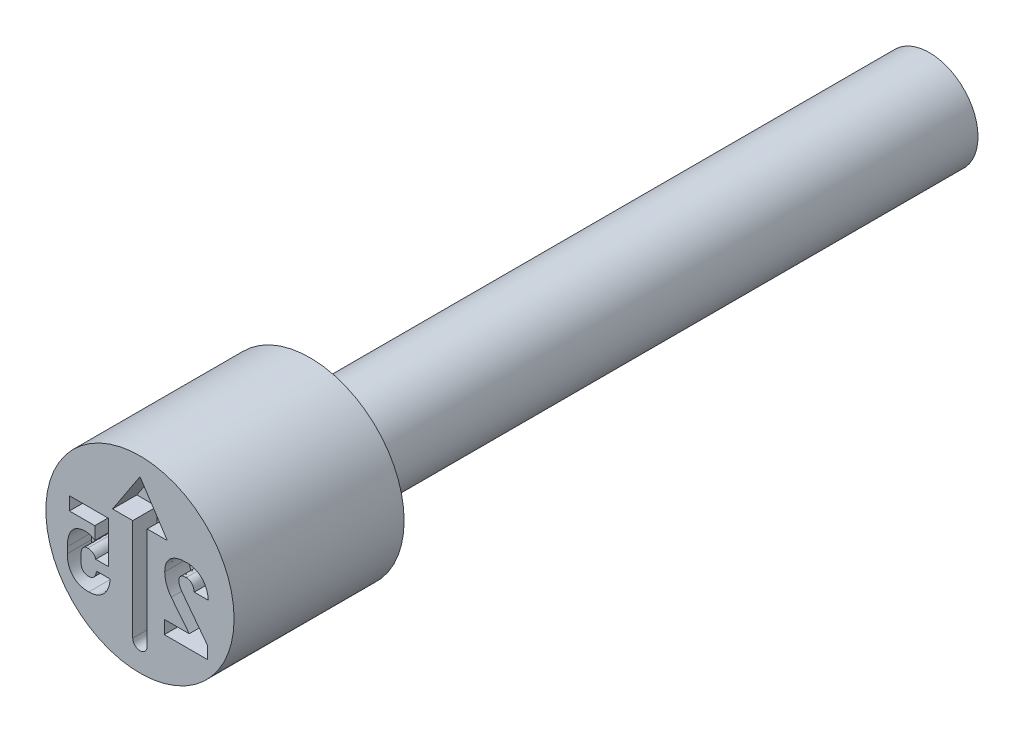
from build123d import *

# Parameters (mm, degrees)
CUT_EXTRUDE4_DEPTH = 0.4
CUT_EXTRUDE5_DEPTH = 0.4


with BuildPart() as part:
    # Sketch2 → Revolve1 (revolve)
    with BuildSketch(Plane(origin=(0, 0, 0), x_dir=(0, 0, -1), z_dir=(1, 0, 0)), mode=Mode.PRIVATE) as revolve1_sk:
        Polygon((0, 1.55), (0, 0), (13, 0), (13, 0.8), (2.8, 0.8), (2.8, 1.55), align=None)
    revolve(revolve1_sk.sketch.rotate(Axis((0, 0, -0.403888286), (0, 0, -1)), 90), axis=Axis((0, 0, -0.403888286), (0, 0, -1)))

    # Sketch3 → Cut-Extrude4 (cut)
    with BuildSketch(Plane.XY):
        with BuildLine():
            Line((0.119045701, 0.566469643), (0.119045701, -1.110101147))
            ThreePointArc((0.119045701, -1.110101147), (0, -1.229146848), (-0.119045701, -1.110101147))
            Line((-0.119045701, -1.110101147), (-0.119045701, 0.566469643))
            Line((-0.119045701, 0.566469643), (-0.451198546, 0.566469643))
            Line((-0.451198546, 0.566469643), (0, 1.251322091))
            Line((0, 1.251322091), (0.451198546, 0.566469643))
            Line((0.451198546, 0.566469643), (0.119045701, 0.566469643))
        make_face()
    extrude(amount=-CUT_EXTRUDE4_DEPTH, mode=Mode.SUBTRACT)

    # Sketch4 → Cut-Extrude5 (cut)
    with BuildSketch(Plane.XY):
        with BuildLine():
            Line((1.11073976, -0.596046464), (0.69891991, -0.054615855))
            add(Edge.make_bspline(
                [(0.69891991, -0.054615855), (0.69028293, -0.042632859), (0.673421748, -0.019239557), (0.6583362, 0.013026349), (0.648752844, 0.038326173), (0.644322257, 0.056678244), (0.641042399, 0.074226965), (0.640660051, 0.085740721), (0.640472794, 0.091379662)],
                knots=[0, 0, 0, 0, 1.660423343, 3.241491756, 3.993801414, 4.704207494, 5.365376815, 6, 6, 6, 6], degree=3))
            Line((0.640472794, 0.091379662), (0.640472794, 0.093091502))
            add(Edge.make_bspline(
                [(0.640472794, 0.093091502), (0.640800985, 0.100797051), (0.641426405, 0.115481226), (0.647464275, 0.136140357), (0.657448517, 0.15400486), (0.671433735, 0.168980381), (0.689223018, 0.18048976), (0.710206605, 0.188897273), (0.734496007, 0.193654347), (0.751721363, 0.194260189), (0.760790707, 0.194579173)],
                knots=[0, 0, 0, 0, 1.033361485, 1.969238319, 2.861873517, 3.760870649, 4.693536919, 5.686153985, 6.781734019, 8, 8, 8, 8], degree=3))
            add(Edge.make_bspline(
                [(0.760790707, 0.194579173), (0.769721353, 0.194201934), (0.787052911, 0.193469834), (0.811707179, 0.186493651), (0.8336084, 0.174650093), (0.85256745, 0.158282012), (0.868475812, 0.137690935), (0.880201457, 0.112885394), (0.889644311, 0.08469284), (0.892384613, 0.064231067), (0.893825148, 0.053474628)],
                knots=[0, 0, 0, 0, 0.993701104, 1.928459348, 2.826878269, 3.748294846, 4.700551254, 5.70417143, 6.793118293, 8, 8, 8, 8], degree=3))
            Line((0.893825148, 0.053474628), (1.125657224, 0.052496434))
            add(Edge.make_bspline(
                [(1.125657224, 0.052496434), (1.123996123, 0.071540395), (1.120760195, 0.106733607), (1.109757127, 0.157344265), (1.093502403, 0.203913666), (1.072734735, 0.246570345), (1.047269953, 0.284775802), (1.01772323, 0.318519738), (0.983767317, 0.347146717), (0.945990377, 0.370934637), (0.904557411, 0.389551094), (0.859975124, 0.403115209), (0.812176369, 0.41093477), (0.779323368, 0.411951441), (0.762502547, 0.412471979)],
                knots=[0, 0, 0, 0, 1.143950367, 2.228484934, 3.258162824, 4.249580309, 5.213917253, 6.146796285, 7.070112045, 8.006232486, 8.954636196, 9.927630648, 10.9389416, 12, 12, 12, 12], degree=3))
            add(Edge.make_bspline(
                [(0.762502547, 0.412471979), (0.744465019, 0.4120949), (0.709554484, 0.411365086), (0.65928566, 0.404494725), (0.613062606, 0.393061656), (0.571001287, 0.376998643), (0.533377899, 0.356350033), (0.50001832, 0.331840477), (0.471864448, 0.302518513), (0.448445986, 0.269208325), (0.429985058, 0.232038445), (0.417056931, 0.191040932), (0.409139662, 0.146545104), (0.408164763, 0.115623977), (0.407662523, 0.099694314)],
                knots=[0, 0, 0, 0, 1.208591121, 2.339154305, 3.392741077, 4.394302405, 5.348037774, 6.261656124, 7.158186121, 8.060194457, 8.981460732, 9.928425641, 10.932785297, 12, 12, 12, 12], degree=3))
            add(Edge.make_bspline(
                [(0.407662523, 0.099694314), (0.407976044, 0.085085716), (0.408603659, 0.057800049), (0.414201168, 0.017036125), (0.423353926, -0.023492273), (0.435772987, -0.063643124), (0.451280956, -0.102745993), (0.469788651, -0.140177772), (0.490918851, -0.175842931), (0.507476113, -0.19789987), (0.515753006, -0.208926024)],
                knots=[0, 0, 0, 0, 0.985191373, 1.972179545, 2.968870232, 3.986806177, 5.007996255, 6.007036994, 7.003727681, 8, 8, 8, 8], degree=3))
            Line((0.515753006, -0.208926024), (0.81116772, -0.582107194))
            Line((0.81116772, -0.582107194), (0.401059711, -0.582107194))
            Line((0.401059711, -0.582107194), (0.401059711, -0.8))
            Line((0.401059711, -0.8), (1.11073976, -0.8))
            Line((1.11073976, -0.8), (1.11073976, -0.596046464))
        make_face()
        with BuildLine():
            add(Edge.make_bspline(
                [(-0.842753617, -0.812471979), (-0.826982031, -0.811990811), (-0.796119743, -0.811049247), (-0.751133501, -0.8025966), (-0.70848508, -0.789506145), (-0.668491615, -0.77083172), (-0.631587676, -0.74710642), (-0.598589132, -0.718094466), (-0.569193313, -0.684555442), (-0.543989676, -0.646195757), (-0.52323347, -0.603425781), (-0.507074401, -0.556749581), (-0.495975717, -0.506251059), (-0.492749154, -0.471216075), (-0.491092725, -0.453230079)],
                knots=[0, 0, 0, 0, 1.013165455, 1.982590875, 2.932437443, 3.87502652, 4.811241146, 5.743574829, 6.690699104, 7.67044025, 8.68537997, 9.739549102, 10.839546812, 12, 12, 12, 12], degree=3))
            Line((-0.491092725, -0.453230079), (-0.717300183, -0.452496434))
            add(Edge.make_bspline(
                [(-0.717300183, -0.452496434), (-0.718591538, -0.463733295), (-0.721052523, -0.483749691), (-0.72992685, -0.511526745), (-0.741512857, -0.535942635), (-0.756817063, -0.556429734), (-0.774990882, -0.57306234), (-0.796526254, -0.584342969), (-0.820327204, -0.591870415), (-0.837231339, -0.592528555), (-0.845932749, -0.592867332)],
                knots=[0, 0, 0, 0, 1.202223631, 2.291125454, 3.30376979, 4.265156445, 5.185306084, 6.082185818, 7.012804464, 8, 8, 8, 8], degree=3))
            add(Edge.make_bspline(
                [(-0.845932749, -0.592867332), (-0.85536434, -0.592456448), (-0.873404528, -0.591670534), (-0.898690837, -0.58408531), (-0.920703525, -0.571941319), (-0.938886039, -0.55446673), (-0.953391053, -0.532693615), (-0.963658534, -0.50662024), (-0.969739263, -0.476660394), (-0.970337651, -0.455380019), (-0.970652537, -0.444181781)],
                knots=[0, 0, 0, 0, 1.026088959, 1.96264217, 2.850204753, 3.743092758, 4.68486217, 5.681854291, 6.780136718, 8, 8, 8, 8], degree=3))
            Line((-0.970652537, -0.444181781), (-0.970652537, -0.343672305))
            add(Edge.make_bspline(
                [(-0.970652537, -0.343672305), (-0.97041102, -0.332474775), (-0.969952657, -0.311223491), (-0.96425063, -0.281496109), (-0.955385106, -0.255559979), (-0.942291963, -0.234029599), (-0.926015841, -0.216651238), (-0.906319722, -0.204308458), (-0.88359921, -0.19701866), (-0.867507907, -0.196164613), (-0.859138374, -0.195720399)],
                knots=[0, 0, 0, 0, 1.281587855, 2.432267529, 3.454745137, 4.406485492, 5.298532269, 6.159104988, 7.042499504, 8, 8, 8, 8], degree=3))
            add(Edge.make_bspline(
                [(-0.859138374, -0.195720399), (-0.851287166, -0.195959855), (-0.836087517, -0.196423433), (-0.814202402, -0.201223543), (-0.794087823, -0.209077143), (-0.775972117, -0.220180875), (-0.759971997, -0.233789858), (-0.746798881, -0.250233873), (-0.735756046, -0.2688147), (-0.73114838, -0.282750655), (-0.728793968, -0.289871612)],
                knots=[0, 0, 0, 0, 1.085085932, 2.100686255, 3.083167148, 4.060192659, 5.028057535, 5.974180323, 6.964852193, 8, 8, 8, 8], degree=3))
            Line((-0.728793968, -0.289871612), (-0.517503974, -0.289871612))
            Line((-0.517503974, -0.289871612), (-0.517503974, 0.4))
            Line((-0.517503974, 0.4), (-1.162134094, 0.4))
            Line((-1.162134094, 0.4), (-1.162134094, 0.182107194))
            Line((-1.162134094, 0.182107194), (-0.743711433, 0.182107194))
            Line((-0.743711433, 0.182107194), (-0.743711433, -0.029916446))
            add(Edge.make_bspline(
                [(-0.743711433, -0.029916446), (-0.748264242, -0.025885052), (-0.757629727, -0.017592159), (-0.774003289, -0.007062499), (-0.792729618, 0.001880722), (-0.820362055, 0.012180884), (-0.856711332, 0.021340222), (-0.886551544, 0.022882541), (-0.901200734, 0.023639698)],
                knots=[0, 0, 0, 0, 0.643749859, 1.324243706, 2.054464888, 2.839075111, 4.448235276, 6, 6, 6, 6], degree=3))
            add(Edge.make_bspline(
                [(-0.901200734, 0.023639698), (-0.916240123, 0.023163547), (-0.945408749, 0.022240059), (-0.987482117, 0.013933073), (-1.026256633, 0.000624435), (-1.061412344, -0.018549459), (-1.092989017, -0.042581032), (-1.12041574, -0.071945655), (-1.143863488, -0.106164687), (-1.16305346, -0.145261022), (-1.178156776, -0.188892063), (-1.189126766, -0.236753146), (-1.195378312, -0.288890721), (-1.196193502, -0.324988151), (-1.196615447, -0.343672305)],
                knots=[0, 0, 0, 0, 1.012739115, 1.964189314, 2.878178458, 3.765675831, 4.65138573, 5.541464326, 6.461953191, 7.437418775, 8.467828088, 9.567356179, 10.740855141, 12, 12, 12, 12], degree=3))
            Line((-1.196615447, -0.343672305), (-1.196615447, -0.444181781))
            add(Edge.make_bspline(
                [(-1.196615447, -0.444181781), (-1.196079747, -0.462871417), (-1.195043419, -0.499027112), (-1.187632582, -0.551310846), (-1.174272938, -0.599270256), (-1.156372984, -0.643215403), (-1.132999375, -0.682273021), (-1.105010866, -0.716773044), (-1.071896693, -0.745918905), (-1.03443837, -0.770447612), (-0.992279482, -0.789259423), (-0.94609373, -0.802925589), (-0.895698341, -0.811054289), (-0.860799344, -0.811988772), (-0.842753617, -0.812471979)],
                knots=[0, 0, 0, 0, 1.159103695, 2.242322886, 3.265299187, 4.239894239, 5.17631577, 6.078070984, 6.98412447, 7.901225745, 8.844758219, 9.836512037, 10.881294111, 12, 12, 12, 12], degree=3))
        make_face()
    extrude(amount=-CUT_EXTRUDE5_DEPTH, mode=Mode.SUBTRACT)


solid = part.part
